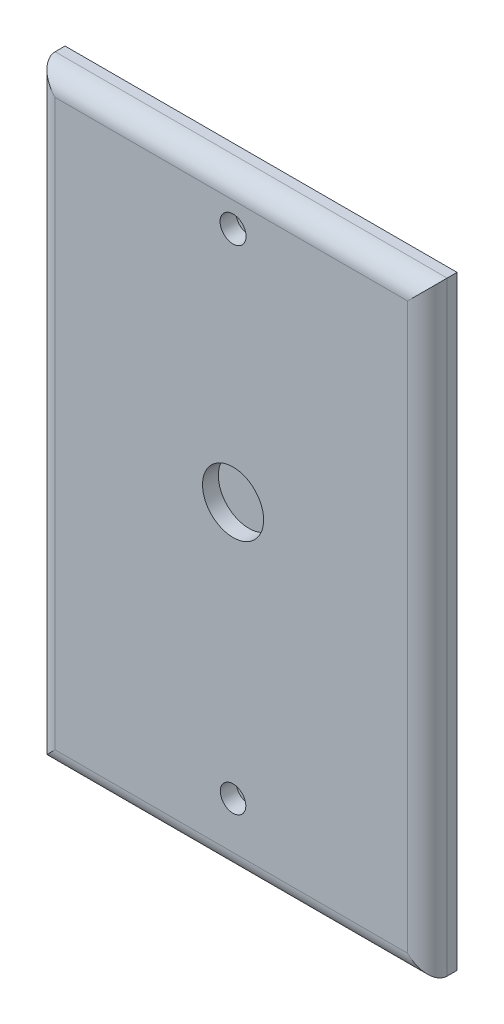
from build123d import *

# Parameters (mm, degrees)
SKETCH1_W          = 201.232511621
SKETCH1_H          = 310.312135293
EXTRUDE1_DEPTH     = 15.24
SKETCH2_R          = 6.672707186
SKETCH2_R_2        = 6.548843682
SKETCH2_R_3        = 15.678364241
CUT_EXTRUDE1_DEPTH = 8.128
FILLET1_R          = 10.16


with BuildPart() as part:
    # Sketch1 → Extrude1 (new body)
    with BuildSketch(Plane.XY):
        with Locations((-13.812785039, -10.715683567)):
            Rectangle(SKETCH1_W, SKETCH1_H)
    extrude(amount=EXTRUDE1_DEPTH)

    # Sketch2 → Cut-Extrude1 (cut)
    with BuildSketch(Plane.XY.offset(15.24)):
        with Locations((-12.935425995, 121.483730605)):
            Circle(SKETCH2_R)
        with Locations((-12.935425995, -131.710621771)):
            Circle(SKETCH2_R_2)
        with Locations((-12.935425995, 0)):
            Circle(SKETCH2_R_3)
    extrude(amount=-CUT_EXTRUDE1_DEPTH, mode=Mode.SUBTRACT)

    # Fillet1
    fillet1_edges = [part.edges().sort_by_distance(p)[0] for p in [
        (86.803470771, -10.715683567, 15.24),
        (-13.81278504, 144.44038408, 15.24),
        (-114.42904085, -10.715683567, 15.24),
        (-13.81278504, -165.871751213, 15.24),
    ]]
    fillet(fillet1_edges, radius=FILLET1_R)


solid = part.part
